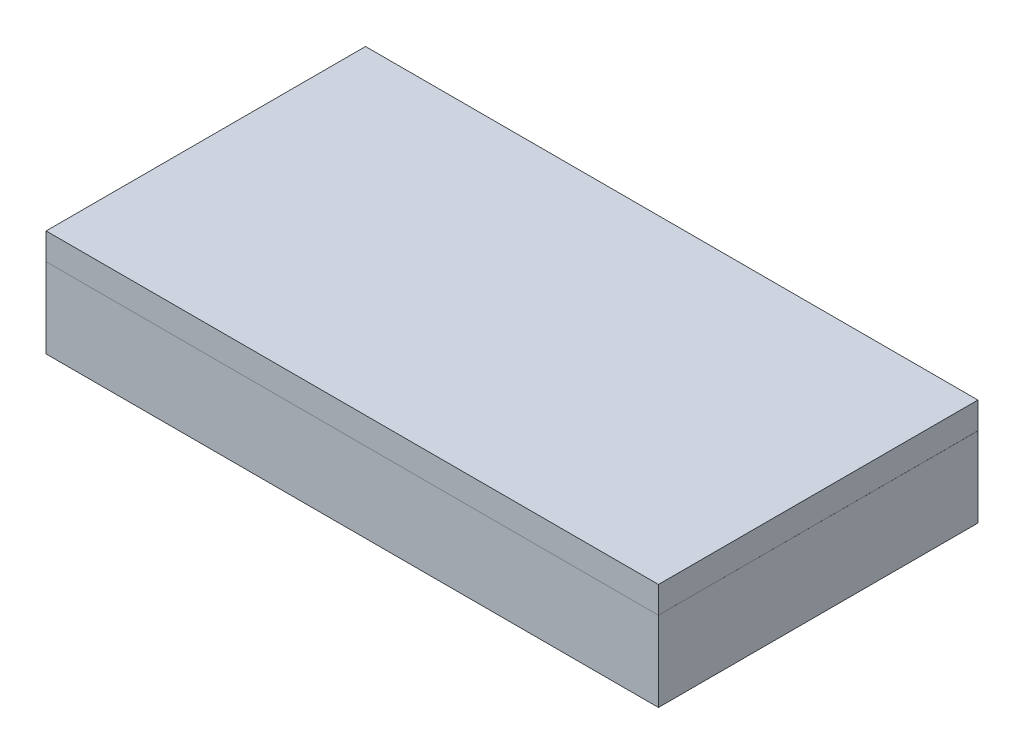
ISO-10303-21;
HEADER;
FILE_DESCRIPTION(('STEP AP214'),'2;1');
FILE_NAME('part.step','',(''),(''),'','','');
FILE_SCHEMA(('AUTOMOTIVE_DESIGN { 1 0 10303 214 1 1 1 1 }'));
ENDSEC;
DATA;
#1=APPLICATION_CONTEXT('core data for automotive mechanical design processes');
#2=APPLICATION_PROTOCOL_DEFINITION('international standard','automotive_design',2000,#1);
#3=PRODUCT_CONTEXT('',#1,'mechanical');
#4=PRODUCT('Part','Part','',(#3));
#5=PRODUCT_RELATED_PRODUCT_CATEGORY('part','',(#4));
#6=PRODUCT_DEFINITION_FORMATION('','',#4);
#7=PRODUCT_DEFINITION_CONTEXT('part definition',#1,'design');
#8=PRODUCT_DEFINITION('design','',#6,#7);
#9=PRODUCT_DEFINITION_SHAPE('','',#8);
#10=(LENGTH_UNIT() NAMED_UNIT(*) SI_UNIT(.MILLI.,.METRE.));
#11=(NAMED_UNIT(*) PLANE_ANGLE_UNIT() SI_UNIT($,.RADIAN.));
#12=(NAMED_UNIT(*) SI_UNIT($,.STERADIAN.) SOLID_ANGLE_UNIT());
#13=UNCERTAINTY_MEASURE_WITH_UNIT(LENGTH_MEASURE(1.E-05),#10,'distance_accuracy_value','');
#14=(GEOMETRIC_REPRESENTATION_CONTEXT(3) GLOBAL_UNCERTAINTY_ASSIGNED_CONTEXT((#13)) GLOBAL_UNIT_ASSIGNED_CONTEXT((#10,
#11,#12)) REPRESENTATION_CONTEXT('',''));
#15=CARTESIAN_POINT('',(0.,0.,0.));
#16=DIRECTION('',(0.,0.,1.));
#17=DIRECTION('',(1.,0.,0.));
#18=AXIS2_PLACEMENT_3D('',#15,#16,#17);
#19=CARTESIAN_POINT('',(0.,15.,0.));
#20=DIRECTION('',(0.,-1.,0.));
#21=DIRECTION('',(0.,0.,-1.));
#22=AXIS2_PLACEMENT_3D('',#19,#20,#21);
#23=PLANE('',#22);
#24=DIRECTION('',(0.,0.,-1.));
#25=VECTOR('',#24,1.);
#26=CARTESIAN_POINT('',(57.49,15.,0.));
#27=LINE('',#26,#25);
#28=CARTESIAN_POINT('',(57.495,15.,29.995));
#29=VERTEX_POINT('',#28);
#30=CARTESIAN_POINT('',(57.49,15.,-29.99));
#31=VERTEX_POINT('',#30);
#32=EDGE_CURVE('E193',#29,#31,#27,.T.);
#33=ORIENTED_EDGE('',*,*,#32,.F.);
#34=DIRECTION('',(0.,0.,-1.));
#35=VECTOR('',#34,1.);
#36=CARTESIAN_POINT('',(57.5,15.,30.));
#37=LINE('',#36,#35);
#38=CARTESIAN_POINT('',(57.5,15.,-30.));
#39=VERTEX_POINT('',#38);
#40=EDGE_CURVE('E99',#29,#39,#37,.T.);
#41=ORIENTED_EDGE('',*,*,#40,.T.);
#42=DIRECTION('',(-1.,0.,0.));
#43=VECTOR('',#42,1.);
#44=CARTESIAN_POINT('',(-57.5,15.,-30.));
#45=LINE('',#44,#43);
#46=CARTESIAN_POINT('',(-57.5,15.,-30.));
#47=VERTEX_POINT('',#46);
#48=EDGE_CURVE('E68',#39,#47,#45,.T.);
#49=ORIENTED_EDGE('',*,*,#48,.T.);
#50=DIRECTION('',(0.,0.,1.));
#51=VECTOR('',#50,1.);
#52=CARTESIAN_POINT('',(-57.5,15.,30.));
#53=LINE('',#52,#51);
#54=CARTESIAN_POINT('',(-57.4935355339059,15.,29.9935355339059));
#55=VERTEX_POINT('',#54);
#56=EDGE_CURVE('E62',#47,#55,#53,.T.);
#57=ORIENTED_EDGE('',*,*,#56,.T.);
#58=DIRECTION('',(0.,0.,1.));
#59=VECTOR('',#58,1.);
#60=CARTESIAN_POINT('',(-57.49,15.,0.));
#61=LINE('',#60,#59);
#62=CARTESIAN_POINT('',(-57.49,15.,-29.99));
#63=VERTEX_POINT('',#62);
#64=EDGE_CURVE('E172',#63,#55,#61,.T.);
#65=ORIENTED_EDGE('',*,*,#64,.F.);
#66=DIRECTION('',(-1.,0.,0.));
#67=VECTOR('',#66,1.);
#68=CARTESIAN_POINT('',(0.,15.,-29.99));
#69=LINE('',#68,#67);
#70=EDGE_CURVE('E52',#31,#63,#69,.T.);
#71=ORIENTED_EDGE('',*,*,#70,.F.);
#72=EDGE_LOOP('',(#33,#41,#49,#57,#65,#71));
#73=FACE_BOUND('',#72,.T.);
#74=ADVANCED_FACE('F34',(#73),#23,.F.);
#75=CARTESIAN_POINT('',(57.5,15.,30.));
#76=DIRECTION('',(-1.,0.,0.));
#77=DIRECTION('',(0.,0.,1.));
#78=AXIS2_PLACEMENT_3D('',#75,#76,#77);
#79=PLANE('',#78);
#80=DIRECTION('',(0.,0.,-1.));
#81=VECTOR('',#80,1.);
#82=CARTESIAN_POINT('',(57.5,0.,30.));
#83=LINE('',#82,#81);
#84=CARTESIAN_POINT('',(57.5,0.,30.));
#85=VERTEX_POINT('',#84);
#86=CARTESIAN_POINT('',(57.5,0.,-30.));
#87=VERTEX_POINT('',#86);
#88=EDGE_CURVE('E104',#85,#87,#83,.T.);
#89=ORIENTED_EDGE('',*,*,#88,.T.);
#90=DIRECTION('',(0.,-1.,0.));
#91=VECTOR('',#90,1.);
#92=CARTESIAN_POINT('',(57.5,15.,-30.));
#93=LINE('',#92,#91);
#94=EDGE_CURVE('E11',#39,#87,#93,.T.);
#95=ORIENTED_EDGE('',*,*,#94,.F.);
#96=ORIENTED_EDGE('',*,*,#40,.F.);
#97=DIRECTION('',(0.,-1.,0.));
#98=VECTOR('',#97,1.);
#99=CARTESIAN_POINT('',(57.5,15.,30.));
#100=LINE('',#99,#98);
#101=EDGE_CURVE('E94',#29,#85,#100,.T.);
#102=ORIENTED_EDGE('',*,*,#101,.T.);
#103=EDGE_LOOP('',(#89,#95,#96,#102));
#104=FACE_BOUND('',#103,.T.);
#105=ADVANCED_FACE('F36',(#104),#79,.F.);
#106=CARTESIAN_POINT('',(-57.5,15.,-30.));
#107=DIRECTION('',(0.,0.,1.));
#108=DIRECTION('',(1.,0.,0.));
#109=AXIS2_PLACEMENT_3D('',#106,#107,#108);
#110=PLANE('',#109);
#111=DIRECTION('',(-1.,0.,0.));
#112=VECTOR('',#111,1.);
#113=CARTESIAN_POINT('',(-57.5,0.,-30.));
#114=LINE('',#113,#112);
#115=CARTESIAN_POINT('',(-57.5,0.,-30.));
#116=VERTEX_POINT('',#115);
#117=EDGE_CURVE('E109',#87,#116,#114,.T.);
#118=ORIENTED_EDGE('',*,*,#117,.T.);
#119=DIRECTION('',(0.,-1.,0.));
#120=VECTOR('',#119,1.);
#121=CARTESIAN_POINT('',(-57.5,15.,-30.));
#122=LINE('',#121,#120);
#123=EDGE_CURVE('E44',#47,#116,#122,.T.);
#124=ORIENTED_EDGE('',*,*,#123,.F.);
#125=ORIENTED_EDGE('',*,*,#48,.F.);
#126=ORIENTED_EDGE('',*,*,#94,.T.);
#127=EDGE_LOOP('',(#118,#124,#125,#126));
#128=FACE_BOUND('',#127,.T.);
#129=ADVANCED_FACE('F139',(#128),#110,.F.);
#130=CARTESIAN_POINT('',(-57.5,15.,30.));
#131=DIRECTION('',(1.,0.,0.));
#132=DIRECTION('',(0.,0.,-1.));
#133=AXIS2_PLACEMENT_3D('',#130,#131,#132);
#134=PLANE('',#133);
#135=DIRECTION('',(0.,0.,1.));
#136=VECTOR('',#135,1.);
#137=CARTESIAN_POINT('',(-57.5,0.,30.));
#138=LINE('',#137,#136);
#139=CARTESIAN_POINT('',(-57.5,0.,30.));
#140=VERTEX_POINT('',#139);
#141=EDGE_CURVE('E84',#116,#140,#138,.T.);
#142=ORIENTED_EDGE('',*,*,#141,.T.);
#143=DIRECTION('',(0.,-1.,0.));
#144=VECTOR('',#143,1.);
#145=CARTESIAN_POINT('',(-57.5,15.,30.));
#146=LINE('',#145,#144);
#147=EDGE_CURVE('E96',#55,#140,#146,.T.);
#148=ORIENTED_EDGE('',*,*,#147,.F.);
#149=ORIENTED_EDGE('',*,*,#56,.F.);
#150=ORIENTED_EDGE('',*,*,#123,.T.);
#151=EDGE_LOOP('',(#142,#148,#149,#150));
#152=FACE_BOUND('',#151,.T.);
#153=ADVANCED_FACE('F136',(#152),#134,.F.);
#154=CARTESIAN_POINT('',(-57.5,15.,30.));
#155=DIRECTION('',(0.,0.,-1.));
#156=DIRECTION('',(-1.,0.,0.));
#157=AXIS2_PLACEMENT_3D('',#154,#155,#156);
#158=PLANE('',#157);
#159=DIRECTION('',(1.,0.,0.));
#160=VECTOR('',#159,1.);
#161=CARTESIAN_POINT('',(-57.5,0.,30.));
#162=LINE('',#161,#160);
#163=EDGE_CURVE('E90',#140,#85,#162,.T.);
#164=ORIENTED_EDGE('',*,*,#163,.T.);
#165=ORIENTED_EDGE('',*,*,#101,.F.);
#166=CARTESIAN_POINT('',(-57.49,15.,29.99));
#167=DIRECTION('',(1.,0.,0.));
#168=VECTOR('',#167,1.);
#169=LINE('',#166,#168);
#170=EDGE_CURVE('E106',#55,#29,#169,.T.);
#171=ORIENTED_EDGE('',*,*,#170,.F.);
#172=ORIENTED_EDGE('',*,*,#147,.T.);
#173=EDGE_LOOP('',(#164,#165,#171,#172));
#174=FACE_BOUND('',#173,.T.);
#175=ADVANCED_FACE('F92',(#174),#158,.F.);
#176=CARTESIAN_POINT('',(0.,0.,0.));
#177=DIRECTION('',(0.,-1.,0.));
#178=DIRECTION('',(0.,0.,-1.));
#179=AXIS2_PLACEMENT_3D('',#176,#177,#178);
#180=PLANE('',#179);
#181=ORIENTED_EDGE('',*,*,#88,.F.);
#182=ORIENTED_EDGE('',*,*,#163,.F.);
#183=ORIENTED_EDGE('',*,*,#141,.F.);
#184=ORIENTED_EDGE('',*,*,#117,.F.);
#185=EDGE_LOOP('',(#181,#182,#183,#184));
#186=FACE_BOUND('',#185,.T.);
#187=ADVANCED_FACE('F108',(#186),#180,.T.);
#188=CARTESIAN_POINT('',(57.49,20.,0.));
#189=DIRECTION('',(-1.,0.,0.));
#190=DIRECTION('',(0.,0.,1.));
#191=AXIS2_PLACEMENT_3D('',#188,#189,#190);
#192=PLANE('',#191);
#193=ORIENTED_EDGE('',*,*,#32,.T.);
#194=DIRECTION('',(0.,-1.,0.));
#195=VECTOR('',#194,1.);
#196=CARTESIAN_POINT('',(57.49,20.,-29.99));
#197=LINE('',#196,#195);
#198=CARTESIAN_POINT('',(57.49,20.,-29.99));
#199=VERTEX_POINT('',#198);
#200=EDGE_CURVE('E110',#199,#31,#197,.T.);
#201=ORIENTED_EDGE('',*,*,#200,.F.);
#202=DIRECTION('',(0.,0.,-1.));
#203=VECTOR('',#202,1.);
#204=CARTESIAN_POINT('',(57.49,20.,0.));
#205=LINE('',#204,#203);
#206=CARTESIAN_POINT('',(57.49,20.,29.99));
#207=VERTEX_POINT('',#206);
#208=EDGE_CURVE('E179',#207,#199,#205,.T.);
#209=ORIENTED_EDGE('',*,*,#208,.F.);
#210=DIRECTION('',(0.,-1.,0.));
#211=VECTOR('',#210,1.);
#212=CARTESIAN_POINT('',(57.49,20.,29.99));
#213=LINE('',#212,#211);
#214=EDGE_CURVE('E185',#207,#29,#213,.T.);
#215=ORIENTED_EDGE('',*,*,#214,.T.);
#216=EDGE_LOOP('',(#193,#201,#209,#215));
#217=FACE_BOUND('',#216,.T.);
#218=ADVANCED_FACE('F149',(#217),#192,.F.);
#219=CARTESIAN_POINT('',(0.,20.,-29.99));
#220=DIRECTION('',(0.,0.,1.));
#221=DIRECTION('',(1.,0.,0.));
#222=AXIS2_PLACEMENT_3D('',#219,#220,#221);
#223=PLANE('',#222);
#224=ORIENTED_EDGE('',*,*,#70,.T.);
#225=DIRECTION('',(0.,-1.,0.));
#226=VECTOR('',#225,1.);
#227=CARTESIAN_POINT('',(-57.49,20.,-29.99));
#228=LINE('',#227,#226);
#229=CARTESIAN_POINT('',(-57.49,20.,-29.99));
#230=VERTEX_POINT('',#229);
#231=EDGE_CURVE('E113',#230,#63,#228,.T.);
#232=ORIENTED_EDGE('',*,*,#231,.F.);
#233=DIRECTION('',(-1.,0.,0.));
#234=VECTOR('',#233,1.);
#235=CARTESIAN_POINT('',(0.,20.,-29.99));
#236=LINE('',#235,#234);
#237=EDGE_CURVE('E212',#199,#230,#236,.T.);
#238=ORIENTED_EDGE('',*,*,#237,.F.);
#239=ORIENTED_EDGE('',*,*,#200,.T.);
#240=EDGE_LOOP('',(#224,#232,#238,#239));
#241=FACE_BOUND('',#240,.T.);
#242=ADVANCED_FACE('F152',(#241),#223,.F.);
#243=CARTESIAN_POINT('',(-57.49,20.,0.));
#244=DIRECTION('',(1.,0.,0.));
#245=DIRECTION('',(0.,0.,-1.));
#246=AXIS2_PLACEMENT_3D('',#243,#244,#245);
#247=PLANE('',#246);
#248=ORIENTED_EDGE('',*,*,#64,.T.);
#249=DIRECTION('',(0.,-1.,0.));
#250=VECTOR('',#249,1.);
#251=CARTESIAN_POINT('',(-57.49,20.,29.99));
#252=LINE('',#251,#250);
#253=CARTESIAN_POINT('',(-57.49,20.,29.99));
#254=VERTEX_POINT('',#253);
#255=EDGE_CURVE('E182',#254,#55,#252,.T.);
#256=ORIENTED_EDGE('',*,*,#255,.F.);
#257=DIRECTION('',(0.,0.,1.));
#258=VECTOR('',#257,1.);
#259=CARTESIAN_POINT('',(-57.49,20.,0.));
#260=LINE('',#259,#258);
#261=EDGE_CURVE('E208',#230,#254,#260,.T.);
#262=ORIENTED_EDGE('',*,*,#261,.F.);
#263=ORIENTED_EDGE('',*,*,#231,.T.);
#264=EDGE_LOOP('',(#248,#256,#262,#263));
#265=FACE_BOUND('',#264,.T.);
#266=ADVANCED_FACE('F156',(#265),#247,.F.);
#267=CARTESIAN_POINT('',(0.,20.,29.99));
#268=DIRECTION('',(0.,0.,-1.));
#269=DIRECTION('',(-1.,0.,0.));
#270=AXIS2_PLACEMENT_3D('',#267,#268,#269);
#271=PLANE('',#270);
#272=ORIENTED_EDGE('',*,*,#170,.T.);
#273=ORIENTED_EDGE('',*,*,#214,.F.);
#274=DIRECTION('',(1.,0.,0.));
#275=VECTOR('',#274,1.);
#276=CARTESIAN_POINT('',(0.,20.,29.99));
#277=LINE('',#276,#275);
#278=EDGE_CURVE('E190',#254,#207,#277,.T.);
#279=ORIENTED_EDGE('',*,*,#278,.F.);
#280=ORIENTED_EDGE('',*,*,#255,.T.);
#281=EDGE_LOOP('',(#272,#273,#279,#280));
#282=FACE_BOUND('',#281,.T.);
#283=ADVANCED_FACE('F160',(#282),#271,.F.);
#284=CARTESIAN_POINT('',(0.,20.,0.));
#285=DIRECTION('',(0.,1.,0.));
#286=DIRECTION('',(0.,0.,1.));
#287=AXIS2_PLACEMENT_3D('',#284,#285,#286);
#288=PLANE('',#287);
#289=ORIENTED_EDGE('',*,*,#208,.T.);
#290=ORIENTED_EDGE('',*,*,#237,.T.);
#291=ORIENTED_EDGE('',*,*,#261,.T.);
#292=ORIENTED_EDGE('',*,*,#278,.T.);
#293=EDGE_LOOP('',(#289,#290,#291,#292));
#294=FACE_BOUND('',#293,.T.);
#295=ADVANCED_FACE('F165',(#294),#288,.T.);
#296=CLOSED_SHELL('',(#74,#105,#129,#153,#175,#187,#218,#242,#266,#283,#295));
#297=MANIFOLD_SOLID_BREP('B2',#296);
#298=ADVANCED_BREP_SHAPE_REPRESENTATION('',(#18,#297),#14);
#299=SHAPE_DEFINITION_REPRESENTATION(#9,#298);
ENDSEC;
END-ISO-10303-21;
